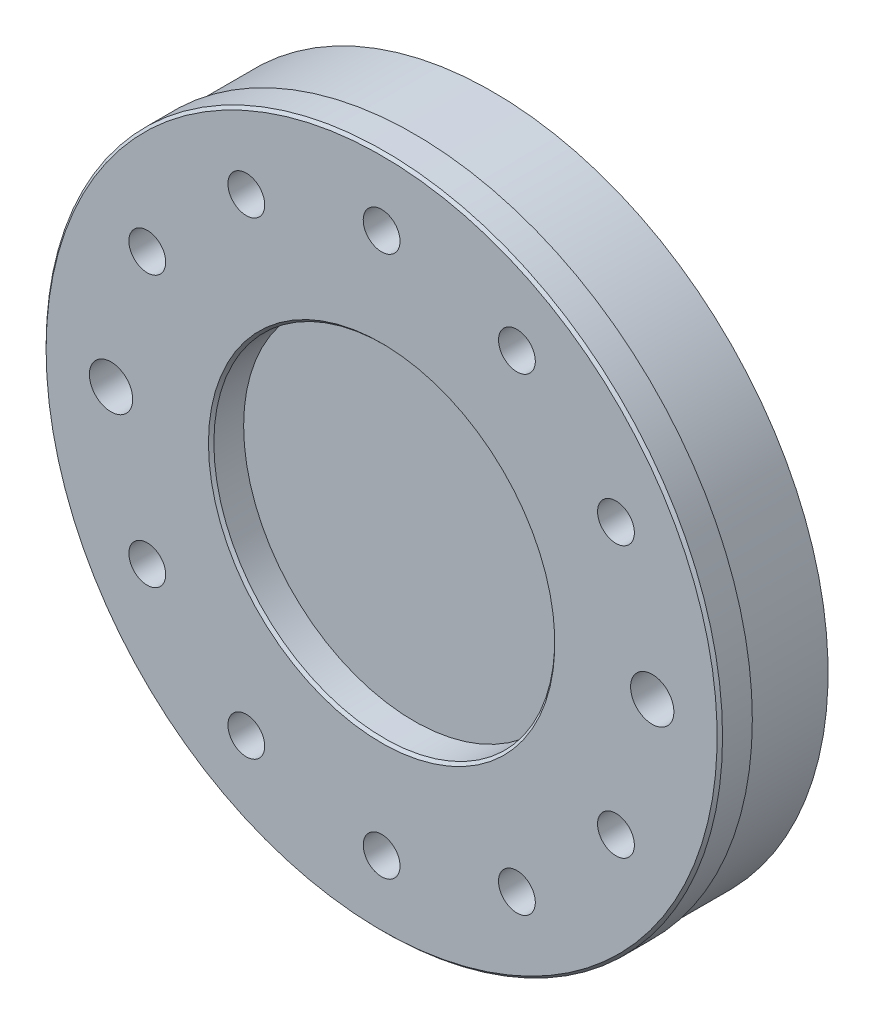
from build123d import *

# Parameters (mm, degrees)
SKETCH2_R                    = 31.5
CUT_EXTRUDE1_DEPTH           = 6
CHAMFER1_SIZE                = 0.5
F_8_0_8_DIAMETER_HOLE1_D     = 8
F_8_0_8_DIAMETER_HOLE1_DEPTH = 15
F_8_0_8_DIAMETER_HOLE1_TIP   = 2.403442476
CIRPATTERN1_COUNT            = 12


with BuildPart() as part:
    # Sketch1 → Revolve1 (revolve)
    with BuildSketch(Plane(origin=(0, 0, 0), x_dir=(1, 0, 0), z_dir=(0, 1, 0)), mode=Mode.PRIVATE) as revolve1_sk:
        Polygon((0, 20.5), (0, 0), (62.5, 0), (62.5, 6), (62, 6), (62, 20.5), align=None)
    revolve(revolve1_sk.sketch.rotate(Axis((0, 0, -20.5), (0, 0, 1)), 180), axis=Axis((0, 0, -20.5), (0, 0, 1)))

    # Sketch2 → Cut-Extrude1 (cut)
    with BuildSketch(Plane(origin=(-20.5, 0, 0), x_dir=(-1, 0, 0), z_dir=(0, 0, -1))):
        with Locations((-20.5, 0)):
            Circle(SKETCH2_R)
    extrude(amount=CUT_EXTRUDE1_DEPTH, mode=Mode.SUBTRACT)

    # Chamfer1
    chamfer1_edges = [part.edges().sort_by_distance(p)[0] for p in [
        (31.5, 0, 0),
        (62.5, 0, 0),
    ]]
    chamfer(chamfer1_edges, length=CHAMFER1_SIZE)

    # 8.0 _8_ Diameter Hole1
    with Locations(Plane(origin=(22.092135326, 42.03834066, 0), x_dir=(1, 0, 0), z_dir=(0, 0, 1))):
        with Locations((27.907864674, -42.03834066), (-72.092135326, -42.03834066)):
            Hole(F_8_0_8_DIAMETER_HOLE1_D / 2, depth=F_8_0_8_DIAMETER_HOLE1_DEPTH)
            with Locations((0, 0, -(F_8_0_8_DIAMETER_HOLE1_DEPTH + F_8_0_8_DIAMETER_HOLE1_TIP / 2))):  # 118° drill point
                Cone(0, F_8_0_8_DIAMETER_HOLE1_D / 2, F_8_0_8_DIAMETER_HOLE1_TIP, mode=Mode.SUBTRACT)

    # Sketch5 → M8x1.25 Tapped Hole1 (revolve, cut)
    with BuildSketch(Plane(origin=(0, -50, 0), x_dir=(0, -1, 0), z_dir=(1, 0, 0))):
        Polygon((0, 0), (0, 20.042926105), (3.4, 18), (3.4, 0), align=None)
    m8x1_25_tapped_hole1 = revolve(axis=Axis((0, -50, 6.35), (0, 0, -1)), mode=Mode.SUBTRACT)

    # CirPattern1: M8x1.25 Tapped Hole1 ×12 about axis, 2 skipped
    cirpattern1_axis = Axis((0, 0, 0), (0, 0, 1))
    add([m8x1_25_tapped_hole1.rotate(cirpattern1_axis, i * 360 / CIRPATTERN1_COUNT) for i in range(1, CIRPATTERN1_COUNT) if i not in (3, 9)], mode=Mode.SUBTRACT)


solid = part.part
